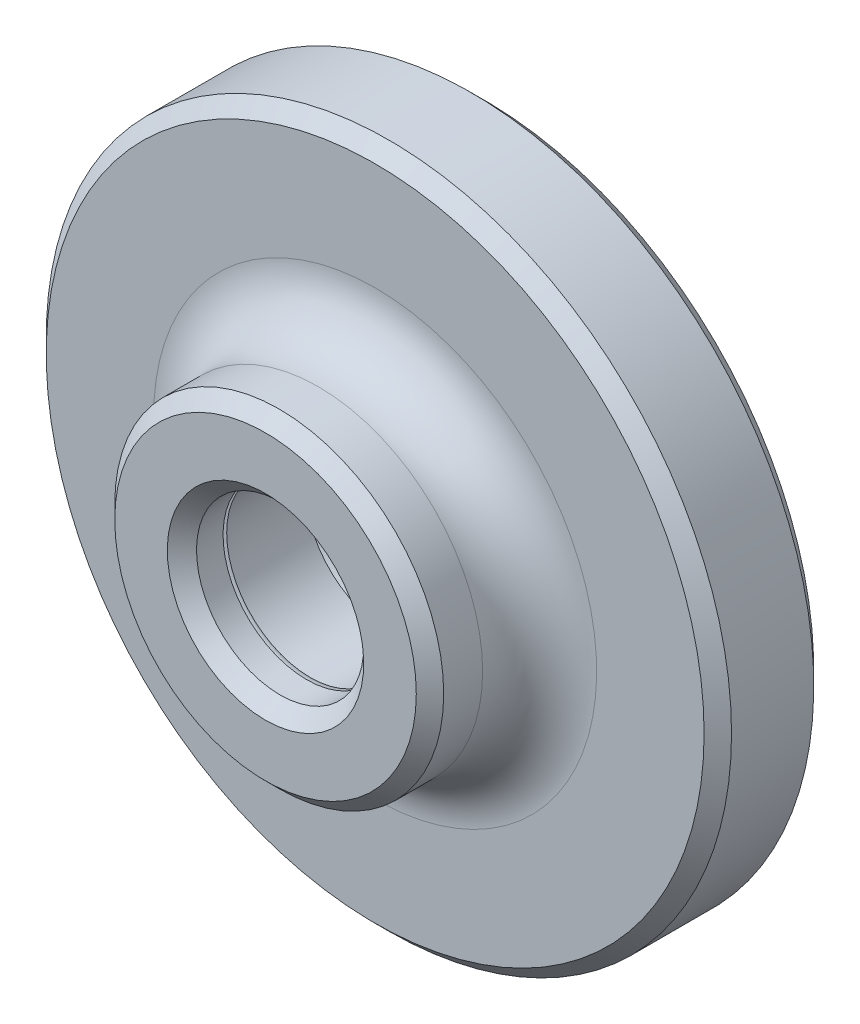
ISO-10303-21;
HEADER;
FILE_DESCRIPTION(('STEP AP214'),'2;1');
FILE_NAME('part.step','',(''),(''),'','','');
FILE_SCHEMA(('AUTOMOTIVE_DESIGN { 1 0 10303 214 1 1 1 1 }'));
ENDSEC;
DATA;
#1=APPLICATION_CONTEXT('core data for automotive mechanical design processes');
#2=APPLICATION_PROTOCOL_DEFINITION('international standard','automotive_design',2000,#1);
#3=PRODUCT_CONTEXT('',#1,'mechanical');
#4=PRODUCT('Part','Part','',(#3));
#5=PRODUCT_RELATED_PRODUCT_CATEGORY('part','',(#4));
#6=PRODUCT_DEFINITION_FORMATION('','',#4);
#7=PRODUCT_DEFINITION_CONTEXT('part definition',#1,'design');
#8=PRODUCT_DEFINITION('design','',#6,#7);
#9=PRODUCT_DEFINITION_SHAPE('','',#8);
#10=(LENGTH_UNIT() NAMED_UNIT(*) SI_UNIT(.MILLI.,.METRE.));
#11=(NAMED_UNIT(*) PLANE_ANGLE_UNIT() SI_UNIT($,.RADIAN.));
#12=(NAMED_UNIT(*) SI_UNIT($,.STERADIAN.) SOLID_ANGLE_UNIT());
#13=UNCERTAINTY_MEASURE_WITH_UNIT(LENGTH_MEASURE(1.E-05),#10,'distance_accuracy_value','');
#14=(GEOMETRIC_REPRESENTATION_CONTEXT(3) GLOBAL_UNCERTAINTY_ASSIGNED_CONTEXT((#13)) GLOBAL_UNIT_ASSIGNED_CONTEXT((#10,
#11,#12)) REPRESENTATION_CONTEXT('',''));
#15=CARTESIAN_POINT('',(0.,0.,0.));
#16=DIRECTION('',(0.,0.,1.));
#17=DIRECTION('',(1.,0.,0.));
#18=AXIS2_PLACEMENT_3D('',#15,#16,#17);
#19=CARTESIAN_POINT('',(0.,0.,3.50000000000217));
#20=DIRECTION('',(0.,0.,1.));
#21=DIRECTION('',(0.,-1.,0.));
#22=AXIS2_PLACEMENT_3D('',#19,#20,#21);
#23=CONICAL_SURFACE('',#22,3.04999999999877,1.0471975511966);
#24=CARTESIAN_POINT('',(0.,0.,1.73908167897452));
#25=VERTEX_POINT('',#24);
#26=VERTEX_LOOP('',#25);
#27=FACE_BOUND('',#26,.T.);
#28=CARTESIAN_POINT('',(0.,0.,3.5));
#29=DIRECTION('',(0.,0.,1.));
#30=DIRECTION('',(0.,-1.,0.));
#31=AXIS2_PLACEMENT_3D('',#28,#29,#30);
#32=CIRCLE('',#31,3.05);
#33=CARTESIAN_POINT('',(0.,-3.05,3.5));
#34=VERTEX_POINT('',#33);
#35=EDGE_CURVE('E34',#34,#34,#32,.T.);
#36=ORIENTED_EDGE('',*,*,#35,.T.);
#37=EDGE_LOOP('',(#36));
#38=FACE_BOUND('',#37,.T.);
#39=ADVANCED_FACE('F14',(#27,#38),#23,.F.);
#40=CARTESIAN_POINT('',(0.,0.,0.));
#41=DIRECTION('',(0.,0.,1.));
#42=DIRECTION('',(0.,-1.,0.));
#43=AXIS2_PLACEMENT_3D('',#40,#41,#42);
#44=CYLINDRICAL_SURFACE('',#43,3.05);
#45=ORIENTED_EDGE('',*,*,#35,.F.);
#46=EDGE_LOOP('',(#45));
#47=FACE_BOUND('',#46,.T.);
#48=CARTESIAN_POINT('',(0.,0.,6.36666666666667));
#49=DIRECTION('',(0.,0.,-1.));
#50=DIRECTION('',(0.,1.,0.));
#51=AXIS2_PLACEMENT_3D('',#48,#49,#50);
#52=CIRCLE('',#51,3.05);
#53=CARTESIAN_POINT('',(0.,3.05,6.36666666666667));
#54=VERTEX_POINT('',#53);
#55=EDGE_CURVE('E36',#54,#54,#52,.F.);
#56=ORIENTED_EDGE('',*,*,#55,.T.);
#57=EDGE_LOOP('',(#56));
#58=FACE_BOUND('',#57,.T.);
#59=ADVANCED_FACE('F31',(#47,#58),#44,.F.);
#60=CARTESIAN_POINT('',(0.,0.,6.66666666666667));
#61=DIRECTION('',(0.,0.,-1.));
#62=DIRECTION('',(0.,1.,0.));
#63=AXIS2_PLACEMENT_3D('',#60,#61,#62);
#64=TOROIDAL_SURFACE('',#63,3.05,0.3);
#65=ORIENTED_EDGE('',*,*,#55,.F.);
#66=EDGE_LOOP('',(#65));
#67=FACE_BOUND('',#66,.T.);
#68=CARTESIAN_POINT('',(0.,0.,6.5));
#69=DIRECTION('',(0.,0.,-1.));
#70=DIRECTION('',(0.,1.,0.));
#71=AXIS2_PLACEMENT_3D('',#68,#69,#70);
#72=CIRCLE('',#71,3.29944382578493);
#73=CARTESIAN_POINT('',(0.,3.29944382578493,6.5));
#74=VERTEX_POINT('',#73);
#75=EDGE_CURVE('E17',#74,#74,#72,.F.);
#76=ORIENTED_EDGE('',*,*,#75,.T.);
#77=EDGE_LOOP('',(#76));
#78=FACE_BOUND('',#77,.T.);
#79=ADVANCED_FACE('F69',(#67,#78),#64,.F.);
#80=CARTESIAN_POINT('',(3.35,0.,6.5));
#81=DIRECTION('',(0.,0.,1.));
#82=DIRECTION('',(0.,-1.,0.));
#83=AXIS2_PLACEMENT_3D('',#80,#81,#82);
#84=PLANE('',#83);
#85=ORIENTED_EDGE('',*,*,#75,.F.);
#86=EDGE_LOOP('',(#85));
#87=FACE_BOUND('',#86,.T.);
#88=CARTESIAN_POINT('',(0.,0.,6.5));
#89=DIRECTION('',(0.,0.,1.));
#90=DIRECTION('',(0.,-1.,0.));
#91=AXIS2_PLACEMENT_3D('',#88,#89,#90);
#92=CIRCLE('',#91,3.05);
#93=CARTESIAN_POINT('',(0.,-3.05,6.5));
#94=VERTEX_POINT('',#93);
#95=EDGE_CURVE('E60',#94,#94,#92,.T.);
#96=ORIENTED_EDGE('',*,*,#95,.T.);
#97=EDGE_LOOP('',(#96));
#98=FACE_BOUND('',#97,.T.);
#99=ADVANCED_FACE('F71',(#87,#98),#84,.F.);
#100=CARTESIAN_POINT('',(0.,0.,0.));
#101=DIRECTION('',(0.,0.,1.));
#102=DIRECTION('',(0.,-1.,0.));
#103=AXIS2_PLACEMENT_3D('',#100,#101,#102);
#104=CYLINDRICAL_SURFACE('',#103,3.05);
#105=ORIENTED_EDGE('',*,*,#95,.F.);
#106=EDGE_LOOP('',(#105));
#107=FACE_BOUND('',#106,.T.);
#108=CARTESIAN_POINT('',(0.,0.,7.46720000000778));
#109=DIRECTION('',(0.,0.,1.));
#110=DIRECTION('',(0.,-1.,0.));
#111=AXIS2_PLACEMENT_3D('',#108,#109,#110);
#112=CIRCLE('',#111,3.04999999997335);
#113=CARTESIAN_POINT('',(0.,-3.04999999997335,7.46720000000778));
#114=VERTEX_POINT('',#113);
#115=EDGE_CURVE('E59',#114,#114,#112,.T.);
#116=ORIENTED_EDGE('',*,*,#115,.T.);
#117=EDGE_LOOP('',(#116));
#118=FACE_BOUND('',#117,.T.);
#119=ADVANCED_FACE('F73',(#107,#118),#104,.F.);
#120=CARTESIAN_POINT('',(0.,0.,7.99999999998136));
#121=DIRECTION('',(0.,0.,1.));
#122=DIRECTION('',(0.,-1.,0.));
#123=AXIS2_PLACEMENT_3D('',#120,#121,#122);
#124=CONICAL_SURFACE('',#123,3.58279999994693,0.785398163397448);
#125=ORIENTED_EDGE('',*,*,#115,.F.);
#126=EDGE_LOOP('',(#125));
#127=FACE_BOUND('',#126,.T.);
#128=CARTESIAN_POINT('',(0.,0.,7.99999999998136));
#129=DIRECTION('',(0.,0.,1.));
#130=DIRECTION('',(0.,-1.,0.));
#131=AXIS2_PLACEMENT_3D('',#128,#129,#130);
#132=CIRCLE('',#131,3.58279999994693);
#133=CARTESIAN_POINT('',(0.,-3.58279999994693,7.99999999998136));
#134=VERTEX_POINT('',#133);
#135=EDGE_CURVE('E57',#134,#134,#132,.T.);
#136=ORIENTED_EDGE('',*,*,#135,.T.);
#137=EDGE_LOOP('',(#136));
#138=FACE_BOUND('',#137,.T.);
#139=ADVANCED_FACE('F81',(#127,#138),#124,.F.);
#140=CARTESIAN_POINT('',(4.05,0.,8.));
#141=DIRECTION('',(0.,0.,-1.));
#142=DIRECTION('',(0.,1.,0.));
#143=AXIS2_PLACEMENT_3D('',#140,#141,#142);
#144=PLANE('',#143);
#145=ORIENTED_EDGE('',*,*,#135,.F.);
#146=EDGE_LOOP('',(#145));
#147=FACE_BOUND('',#146,.T.);
#148=CARTESIAN_POINT('',(0.,0.,7.99999999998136));
#149=DIRECTION('',(0.,0.,-1.));
#150=DIRECTION('',(1.,0.,0.));
#151=AXIS2_PLACEMENT_3D('',#148,#149,#150);
#152=CIRCLE('',#151,5.50000000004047);
#153=CARTESIAN_POINT('',(5.50000000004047,0.,7.99999999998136));
#154=VERTEX_POINT('',#153);
#155=EDGE_CURVE('E53',#154,#154,#152,.T.);
#156=ORIENTED_EDGE('',*,*,#155,.F.);
#157=EDGE_LOOP('',(#156));
#158=FACE_BOUND('',#157,.T.);
#159=ADVANCED_FACE('F238',(#147,#158),#144,.F.);
#160=CARTESIAN_POINT('',(0.,0.,7.50000000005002));
#161=DIRECTION('',(0.,0.,-1.));
#162=DIRECTION('',(1.,0.,0.));
#163=AXIS2_PLACEMENT_3D('',#160,#161,#162);
#164=CONICAL_SURFACE('',#163,5.99999999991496,0.785398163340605);
#165=ORIENTED_EDGE('',*,*,#155,.T.);
#166=EDGE_LOOP('',(#165));
#167=FACE_BOUND('',#166,.T.);
#168=CARTESIAN_POINT('',(0.,0.,7.5));
#169=DIRECTION('',(0.,0.,1.));
#170=DIRECTION('',(0.,-1.,0.));
#171=AXIS2_PLACEMENT_3D('',#168,#169,#170);
#172=CIRCLE('',#171,6.);
#173=CARTESIAN_POINT('',(0.,-6.,7.5));
#174=VERTEX_POINT('',#173);
#175=EDGE_CURVE('E56',#174,#174,#172,.F.);
#176=ORIENTED_EDGE('',*,*,#175,.F.);
#177=EDGE_LOOP('',(#176));
#178=FACE_BOUND('',#177,.T.);
#179=ADVANCED_FACE('F230',(#167,#178),#164,.T.);
#180=CARTESIAN_POINT('',(0.,0.,0.));
#181=DIRECTION('',(0.,0.,1.));
#182=DIRECTION('',(0.,-1.,0.));
#183=AXIS2_PLACEMENT_3D('',#180,#181,#182);
#184=CYLINDRICAL_SURFACE('',#183,6.);
#185=ORIENTED_EDGE('',*,*,#175,.T.);
#186=EDGE_LOOP('',(#185));
#187=FACE_BOUND('',#186,.T.);
#188=CARTESIAN_POINT('',(0.,0.,6.08));
#189=DIRECTION('',(0.,0.,-1.));
#190=DIRECTION('',(0.,1.,0.));
#191=AXIS2_PLACEMENT_3D('',#188,#189,#190);
#192=CIRCLE('',#191,6.);
#193=CARTESIAN_POINT('',(0.,6.,6.08));
#194=VERTEX_POINT('',#193);
#195=EDGE_CURVE('E133',#194,#194,#192,.F.);
#196=ORIENTED_EDGE('',*,*,#195,.T.);
#197=EDGE_LOOP('',(#196));
#198=FACE_BOUND('',#197,.T.);
#199=ADVANCED_FACE('F223',(#187,#198),#184,.T.);
#200=CARTESIAN_POINT('',(0.,0.,6.08));
#201=DIRECTION('',(0.,0.,-1.));
#202=DIRECTION('',(0.,1.,0.));
#203=AXIS2_PLACEMENT_3D('',#200,#201,#202);
#204=TOROIDAL_SURFACE('',#203,8.08,2.08);
#205=ORIENTED_EDGE('',*,*,#195,.F.);
#206=EDGE_LOOP('',(#205));
#207=FACE_BOUND('',#206,.T.);
#208=CARTESIAN_POINT('',(0.,0.,4.));
#209=DIRECTION('',(0.,0.,1.));
#210=DIRECTION('',(0.,1.,0.));
#211=AXIS2_PLACEMENT_3D('',#208,#209,#210);
#212=CIRCLE('',#211,8.08);
#213=CARTESIAN_POINT('',(0.,8.08,4.));
#214=VERTEX_POINT('',#213);
#215=EDGE_CURVE('E52',#214,#214,#212,.T.);
#216=ORIENTED_EDGE('',*,*,#215,.T.);
#217=EDGE_LOOP('',(#216));
#218=FACE_BOUND('',#217,.T.);
#219=ADVANCED_FACE('F115',(#207,#218),#204,.F.);
#220=CARTESIAN_POINT('',(8.,0.,4.));
#221=DIRECTION('',(0.,0.,-1.));
#222=DIRECTION('',(0.,1.,0.));
#223=AXIS2_PLACEMENT_3D('',#220,#221,#222);
#224=PLANE('',#223);
#225=ORIENTED_EDGE('',*,*,#215,.F.);
#226=EDGE_LOOP('',(#225));
#227=FACE_BOUND('',#226,.T.);
#228=CARTESIAN_POINT('',(0.,0.,4.));
#229=DIRECTION('',(0.,0.,-1.));
#230=DIRECTION('',(1.,0.,0.));
#231=AXIS2_PLACEMENT_3D('',#228,#229,#230);
#232=CIRCLE('',#231,12.);
#233=CARTESIAN_POINT('',(12.,0.,4.));
#234=VERTEX_POINT('',#233);
#235=EDGE_CURVE('E48',#234,#234,#232,.T.);
#236=ORIENTED_EDGE('',*,*,#235,.F.);
#237=EDGE_LOOP('',(#236));
#238=FACE_BOUND('',#237,.T.);
#239=ADVANCED_FACE('F110',(#227,#238),#224,.F.);
#240=CARTESIAN_POINT('',(0.,0.,3.5));
#241=DIRECTION('',(0.,0.,-1.));
#242=DIRECTION('',(1.,0.,0.));
#243=AXIS2_PLACEMENT_3D('',#240,#241,#242);
#244=CONICAL_SURFACE('',#243,12.5,0.785398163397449);
#245=ORIENTED_EDGE('',*,*,#235,.T.);
#246=EDGE_LOOP('',(#245));
#247=FACE_BOUND('',#246,.T.);
#248=CARTESIAN_POINT('',(0.,0.,3.5));
#249=DIRECTION('',(0.,0.,1.));
#250=DIRECTION('',(0.,-1.,0.));
#251=AXIS2_PLACEMENT_3D('',#248,#249,#250);
#252=CIRCLE('',#251,12.5);
#253=CARTESIAN_POINT('',(0.,-12.5,3.5));
#254=VERTEX_POINT('',#253);
#255=EDGE_CURVE('E51',#254,#254,#252,.F.);
#256=ORIENTED_EDGE('',*,*,#255,.F.);
#257=EDGE_LOOP('',(#256));
#258=FACE_BOUND('',#257,.T.);
#259=ADVANCED_FACE('F106',(#247,#258),#244,.T.);
#260=CARTESIAN_POINT('',(0.,0.,0.));
#261=DIRECTION('',(0.,0.,1.));
#262=DIRECTION('',(0.,-1.,0.));
#263=AXIS2_PLACEMENT_3D('',#260,#261,#262);
#264=CYLINDRICAL_SURFACE('',#263,12.5);
#265=ORIENTED_EDGE('',*,*,#255,.T.);
#266=EDGE_LOOP('',(#265));
#267=FACE_BOUND('',#266,.T.);
#268=CARTESIAN_POINT('',(0.,0.,0.5));
#269=DIRECTION('',(0.,0.,1.));
#270=DIRECTION('',(0.,-1.,0.));
#271=AXIS2_PLACEMENT_3D('',#268,#269,#270);
#272=CIRCLE('',#271,12.5);
#273=CARTESIAN_POINT('',(0.,-12.5,0.5));
#274=VERTEX_POINT('',#273);
#275=EDGE_CURVE('E47',#274,#274,#272,.F.);
#276=ORIENTED_EDGE('',*,*,#275,.F.);
#277=EDGE_LOOP('',(#276));
#278=FACE_BOUND('',#277,.T.);
#279=ADVANCED_FACE('F103',(#267,#278),#264,.T.);
#280=CARTESIAN_POINT('',(0.,0.,3.99680288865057E-12));
#281=DIRECTION('',(0.,0.,-1.));
#282=DIRECTION('',(0.,1.,0.));
#283=AXIS2_PLACEMENT_3D('',#280,#281,#282);
#284=CONICAL_SURFACE('',#283,0.998567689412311,1.02974425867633);
#285=CARTESIAN_POINT('',(0.,-2.22044604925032E-13,0.600000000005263));
#286=VERTEX_POINT('',#285);
#287=VERTEX_LOOP('',#286);
#288=FACE_BOUND('',#287,.T.);
#289=CARTESIAN_POINT('',(0.,0.,3.86338502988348E-12));
#290=DIRECTION('',(0.,0.,-1.));
#291=DIRECTION('',(0.,1.,0.));
#292=AXIS2_PLACEMENT_3D('',#289,#290,#291);
#293=CIRCLE('',#292,0.998567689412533);
#294=CARTESIAN_POINT('',(0.,0.998567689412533,3.86338502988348E-12));
#295=VERTEX_POINT('',#294);
#296=EDGE_CURVE('E23',#295,#295,#293,.T.);
#297=ORIENTED_EDGE('',*,*,#296,.T.);
#298=EDGE_LOOP('',(#297));
#299=FACE_BOUND('',#298,.T.);
#300=ADVANCED_FACE('F95',(#288,#299),#284,.F.);
#301=CARTESIAN_POINT('',(0.,0.,0.5));
#302=DIRECTION('',(0.,0.,1.));
#303=DIRECTION('',(-1.,0.,0.));
#304=AXIS2_PLACEMENT_3D('',#301,#302,#303);
#305=CONICAL_SURFACE('',#304,12.5,0.785398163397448);
#306=ORIENTED_EDGE('',*,*,#275,.T.);
#307=EDGE_LOOP('',(#306));
#308=FACE_BOUND('',#307,.T.);
#309=CARTESIAN_POINT('',(0.,0.,0.));
#310=DIRECTION('',(0.,0.,1.));
#311=DIRECTION('',(-1.,0.,0.));
#312=AXIS2_PLACEMENT_3D('',#309,#310,#311);
#313=CIRCLE('',#312,12.);
#314=CARTESIAN_POINT('',(-12.,0.,0.));
#315=VERTEX_POINT('',#314);
#316=EDGE_CURVE('E9',#315,#315,#313,.T.);
#317=ORIENTED_EDGE('',*,*,#316,.T.);
#318=EDGE_LOOP('',(#317));
#319=FACE_BOUND('',#318,.T.);
#320=ADVANCED_FACE('F88',(#308,#319),#305,.T.);
#321=CARTESIAN_POINT('',(12.,0.,0.));
#322=DIRECTION('',(0.,0.,1.));
#323=DIRECTION('',(0.,-1.,0.));
#324=AXIS2_PLACEMENT_3D('',#321,#322,#323);
#325=PLANE('',#324);
#326=ORIENTED_EDGE('',*,*,#316,.F.);
#327=EDGE_LOOP('',(#326));
#328=FACE_BOUND('',#327,.T.);
#329=ORIENTED_EDGE('',*,*,#296,.F.);
#330=EDGE_LOOP('',(#329));
#331=FACE_BOUND('',#330,.T.);
#332=ADVANCED_FACE('F86',(#328,#331),#325,.F.);
#333=CLOSED_SHELL('',(#39,#59,#79,#99,#119,#139,#159,#179,#199,#219,#239,#259,#279,#300,#320,#332));
#334=MANIFOLD_SOLID_BREP('B1',#333);
#335=ADVANCED_BREP_SHAPE_REPRESENTATION('',(#18,#334),#14);
#336=SHAPE_DEFINITION_REPRESENTATION(#9,#335);
ENDSEC;
END-ISO-10303-21;
